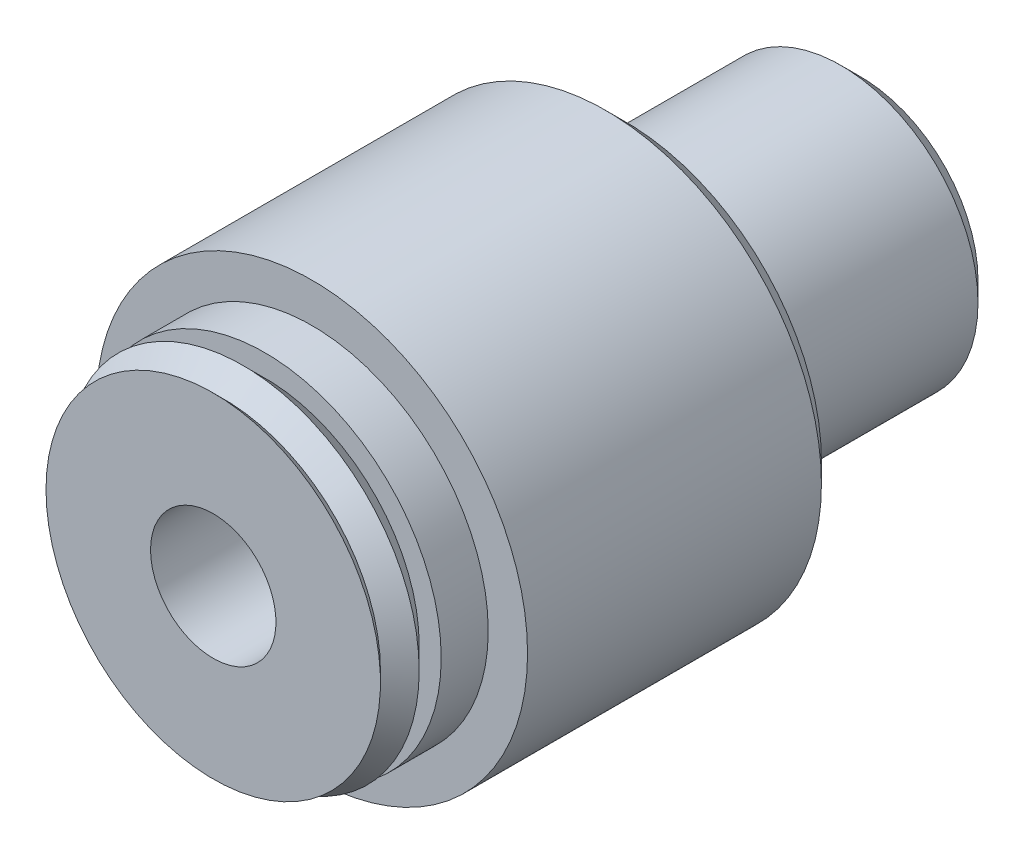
from build123d import *

# Parameters (mm, degrees)
SKETCH4_R                        = 8.7376
DOUBLE_ACTING_STUD_BODY_DEPTH    = 12.7
SKETCH5_R                        = 5.55625
DOUBLE_ACTING_STUD_BODY_2_DEPTH  = 9.525
DOUBLE_ACTING_STUD_CHAMFER_SIZE  = 0.79375
SKETCH8_R                        = 2.032
DOUBLE_ACTING_STUD_PORT_A1_DEPTH = 29.988760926
SKETCH3_R                        = 2.54
HOLE_CUT_DEPTH                   = 29.988760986


with BuildPart() as part:
    # Sketch1 → Base (revolve)
    with BuildSketch(Plane(origin=(0, 0, 0), x_dir=(0, 0, -1), z_dir=(1, 0, 0)), mode=Mode.PRIVATE) as base_sk:
        Polygon((0, 0), (0, 6.77545), (0.41656, 6.35889), (1.20142, 7.14375), (2.093214, 6.251956), (2.093214, 7.14375), (3.998214, 7.14375), (3.998214, 0), align=None)
    revolve(base_sk.sketch.rotate(Axis((0, 0, -71.294124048), (0, 0, 1)), 90), axis=Axis((0, 0, -71.294124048), (0, 0, 1)))

    # Sketch4 → Double Acting Stud Body (add)
    with BuildSketch(Plane.XY.offset(-3.998214)):
        Circle(SKETCH4_R)
    extrude(amount=-DOUBLE_ACTING_STUD_BODY_DEPTH)

    # Sketch5 → Double Acting Stud Body 2 (add)
    with BuildSketch(Plane(origin=(0, 0, -16.698214), x_dir=(-1, 0, 0), z_dir=(0, 0, -1))):
        with Locations(Location((0, 0, 0), (0, 0, 180))):
            Circle(SKETCH5_R)
    extrude(amount=DOUBLE_ACTING_STUD_BODY_2_DEPTH)

    # Double Acting Stud Chamfer
    double_acting_stud_chamfer_edges = [part.edges().sort_by_distance(p)[0] for p in [
        (-8.7376, 0, -16.698214),
        (-5.55625, 0, -26.223214),
    ]]
    chamfer(double_acting_stud_chamfer_edges, length=DOUBLE_ACTING_STUD_CHAMFER_SIZE)

    # Sketch8 → Double Acting Stud Port A1 (cut, through all)
    with BuildSketch(Plane(origin=(0, 0, 0), x_dir=(0, 0, -1), z_dir=(1, 0, 0))):
        with Locations((7.173214, 0)):
            Circle(SKETCH8_R)
    extrude(amount=-DOUBLE_ACTING_STUD_PORT_A1_DEPTH, mode=Mode.SUBTRACT)

    # Sketch3 → Hole Cut (cut, through all)
    with BuildSketch(Plane(origin=(0, 0, 0), x_dir=(-1, 0, 0), z_dir=(0, 0, -1))):
        Circle(SKETCH3_R)
    extrude(amount=HOLE_CUT_DEPTH, mode=Mode.SUBTRACT)


solid = part.part
